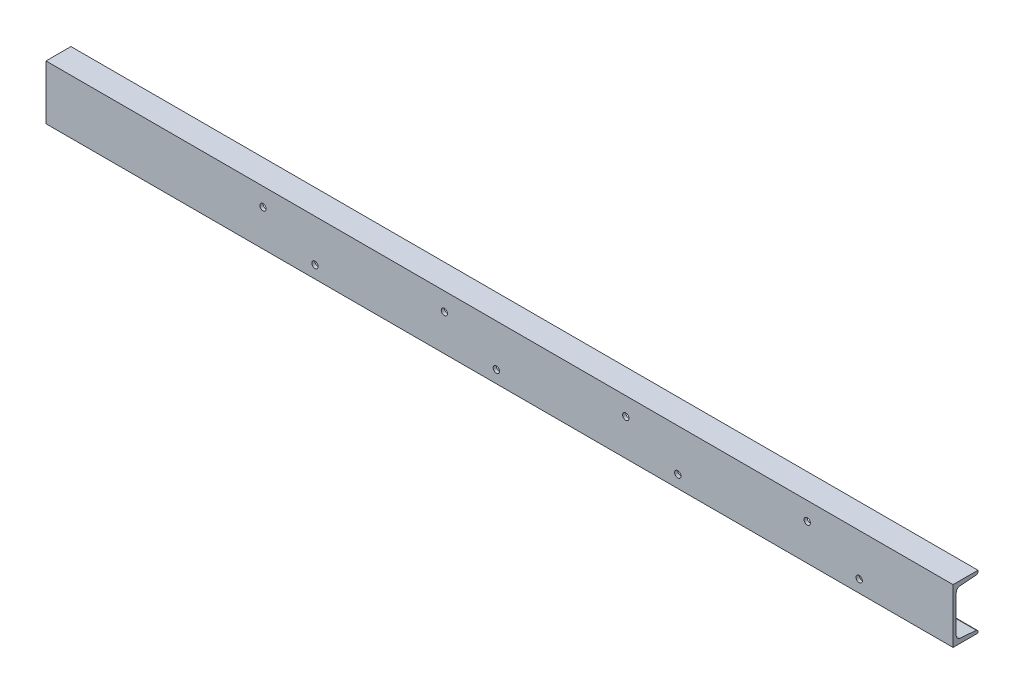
from build123d import *

# Parameters (mm, degrees)
CEOWNIKI_UPN120_1_DEPTH = 2000
OTW_R_14_0_14_1_D       = 14
OTW_R_14_0_14_11_D      = 14
OTW_R_14_0_14_11_DEPTH  = 55
OTW_R_14_0_14_13_D      = 14


with BuildPart() as part:
    # Sketch1 → Ceowniki UPN120_1 (new body)
    with BuildSketch(Plane(origin=(0, 0, 0), x_dir=(0, 0, -1), z_dir=(-1, 0, 0))):
        with BuildLine():
            Line((55, 120), (0, 120))
            Line((0, 120), (0, 0))
            Line((0, 0), (55, 0))
            Line((55, 0), (55, 2.64559066))
            ThreePointArc((55, 2.64559066), (53.80642318, 5.698059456), (50.858859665, 7.13125892))
            Line((50.858859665, 7.13125892), (15.28228067, 9.977434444))
            ThreePointArc((15.28228067, 9.977434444), (9.38715364, 12.843833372), (7, 18.948770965))
            Line((7, 18.948770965), (7, 101.051229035))
            ThreePointArc((7, 101.051229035), (9.38715364, 107.156166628), (15.28228067, 110.022565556))
            Line((15.28228067, 110.022565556), (50.858859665, 112.86874108))
            ThreePointArc((50.858859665, 112.86874108), (53.80642318, 114.301940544), (55, 117.35440934))
            Line((55, 117.35440934), (55, 120))
        make_face()
    extrude(amount=-CEOWNIKI_UPN120_1_DEPTH)

    # Otw_r _14.0 _14_1 (through all)
    with Locations(Plane.XY):
        with Locations((1678.466142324, -40), (478.466142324, -40), (878.466142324, -40), (1278.466142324, -40)):
            Hole(OTW_R_14_0_14_1_D / 2)

    # Otw_r _14.0 _14_11
    with Locations(Plane(origin=(216.868720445, 0, 0), x_dir=(1, 0, 0), z_dir=(0, 0, 1))):
        with Locations((1061.597421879, -40), (261.597421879, -40), (661.597421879, -40)):
            Hole(OTW_R_14_0_14_11_D / 2, depth=OTW_R_14_0_14_11_DEPTH)

    # Otw_r _14.0 _14_13 (through all)
    with Locations(Plane(origin=(331.445579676, -52.774396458, 0), x_dir=(1, 0, 0), z_dir=(0, 0, 1))):
        with Locations((1461.597421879, -40), (261.597421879, -40), (661.597421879, -40), (1061.597421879, -40)):
            Hole(OTW_R_14_0_14_13_D / 2)


solid = part.part
